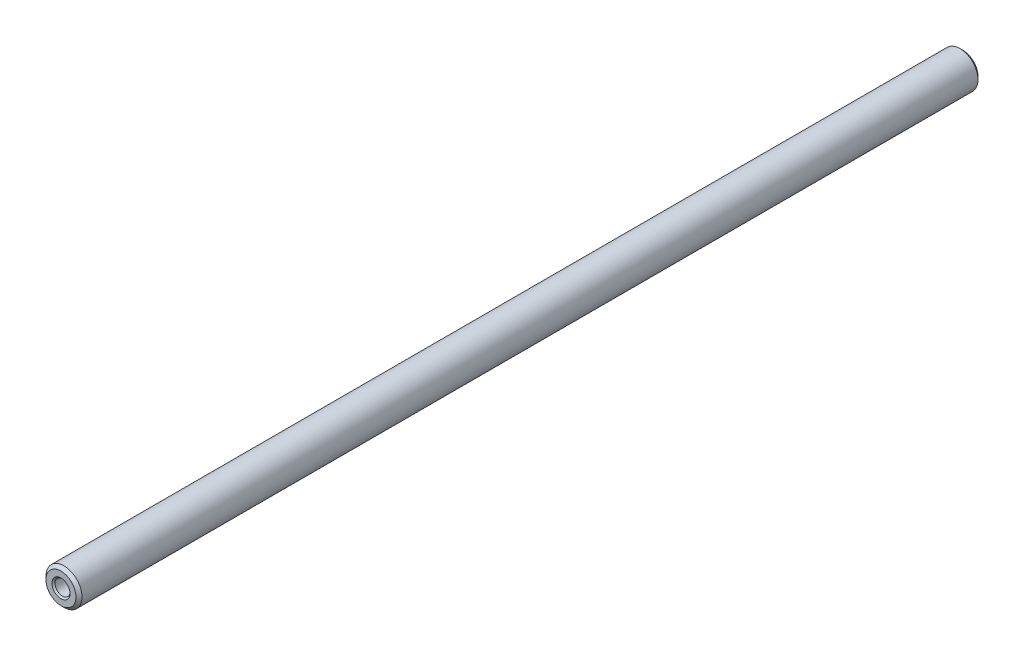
from build123d import *

# Parameters (mm, degrees)
SKETCH1_R                       = 2.995
BOSS_EXTRUDE1_DEPTH             = 150
M3X0_5_TAPPED_HOLE1_D           = 2.5
M3X0_5_TAPPED_HOLE1_DEPTH       = 3
M3X0_5_TAPPED_HOLE1_CSINK_D     = 3
M3X0_5_TAPPED_HOLE1_CSINK_ANGLE = 90
M3X0_5_TAPPED_HOLE1_TIP         = 0.751075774
M3X0_5_TAPPED_HOLE2_D           = 2.5
M3X0_5_TAPPED_HOLE2_DEPTH       = 3
M3X0_5_TAPPED_HOLE2_CSINK_D     = 3
M3X0_5_TAPPED_HOLE2_CSINK_ANGLE = 90
M3X0_5_TAPPED_HOLE2_TIP         = 0.751075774
CHAMFER1_SIZE                   = 0.5


with BuildPart() as part:
    # Sketch1 → Boss-Extrude1 (new body)
    with BuildSketch(Plane.XY):
        Circle(SKETCH1_R)
    extrude(amount=BOSS_EXTRUDE1_DEPTH)

    # M3x0.5 Tapped Hole1
    with Locations(Plane.XY.offset(150)):
        with Locations((0, 0)):
            CounterSinkHole(M3X0_5_TAPPED_HOLE1_D / 2, M3X0_5_TAPPED_HOLE1_CSINK_D / 2, depth=M3X0_5_TAPPED_HOLE1_DEPTH, counter_sink_angle=M3X0_5_TAPPED_HOLE1_CSINK_ANGLE)
            with Locations((0, 0, -(M3X0_5_TAPPED_HOLE1_DEPTH + M3X0_5_TAPPED_HOLE1_TIP / 2))):  # 118° drill point
                Cone(0, M3X0_5_TAPPED_HOLE1_D / 2, M3X0_5_TAPPED_HOLE1_TIP, mode=Mode.SUBTRACT)

    # M3x0.5 Tapped Hole2
    with Locations(Plane(origin=(0, 0, 0), x_dir=(-1, 0, 0), z_dir=(0, 0, -1))):
        with Locations((0, 0)):
            CounterSinkHole(M3X0_5_TAPPED_HOLE2_D / 2, M3X0_5_TAPPED_HOLE2_CSINK_D / 2, depth=M3X0_5_TAPPED_HOLE2_DEPTH, counter_sink_angle=M3X0_5_TAPPED_HOLE2_CSINK_ANGLE)
            with Locations((0, 0, -(M3X0_5_TAPPED_HOLE2_DEPTH + M3X0_5_TAPPED_HOLE2_TIP / 2))):  # 118° drill point
                Cone(0, M3X0_5_TAPPED_HOLE2_D / 2, M3X0_5_TAPPED_HOLE2_TIP, mode=Mode.SUBTRACT)

    # Chamfer1
    chamfer1_edges = [part.edges().sort_by_distance(p)[0] for p in [
        (-2.995, 0, 0),
        (-2.995, 0, 150),
    ]]
    chamfer(chamfer1_edges, length=CHAMFER1_SIZE)


solid = part.part
